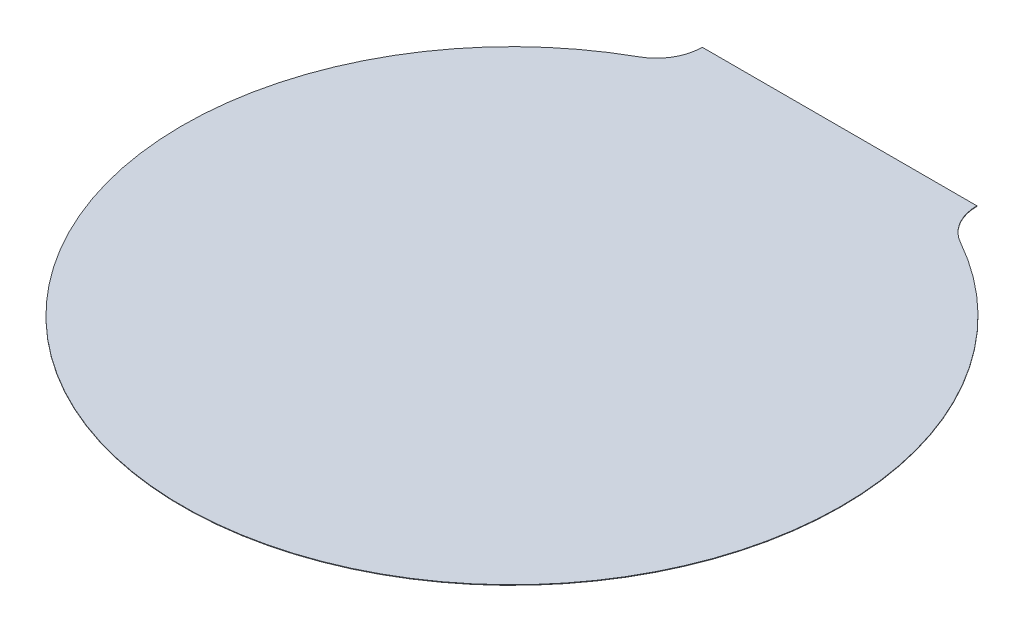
ISO-10303-21;
HEADER;
FILE_DESCRIPTION(('STEP AP214'),'2;1');
FILE_NAME('part.step','',(''),(''),'','','');
FILE_SCHEMA(('AUTOMOTIVE_DESIGN { 1 0 10303 214 1 1 1 1 }'));
ENDSEC;
DATA;
#1=APPLICATION_CONTEXT('core data for automotive mechanical design processes');
#2=APPLICATION_PROTOCOL_DEFINITION('international standard','automotive_design',2000,#1);
#3=PRODUCT_CONTEXT('',#1,'mechanical');
#4=PRODUCT('Part','Part','',(#3));
#5=PRODUCT_RELATED_PRODUCT_CATEGORY('part','',(#4));
#6=PRODUCT_DEFINITION_FORMATION('','',#4);
#7=PRODUCT_DEFINITION_CONTEXT('part definition',#1,'design');
#8=PRODUCT_DEFINITION('design','',#6,#7);
#9=PRODUCT_DEFINITION_SHAPE('','',#8);
#10=(LENGTH_UNIT() NAMED_UNIT(*) SI_UNIT(.MILLI.,.METRE.));
#11=(NAMED_UNIT(*) PLANE_ANGLE_UNIT() SI_UNIT($,.RADIAN.));
#12=(NAMED_UNIT(*) SI_UNIT($,.STERADIAN.) SOLID_ANGLE_UNIT());
#13=UNCERTAINTY_MEASURE_WITH_UNIT(LENGTH_MEASURE(1.E-05),#10,'distance_accuracy_value','');
#14=(GEOMETRIC_REPRESENTATION_CONTEXT(3) GLOBAL_UNCERTAINTY_ASSIGNED_CONTEXT((#13)) GLOBAL_UNIT_ASSIGNED_CONTEXT((#10,
#11,#12)) REPRESENTATION_CONTEXT('',''));
#15=CARTESIAN_POINT('',(0.,0.,0.));
#16=DIRECTION('',(0.,0.,1.));
#17=DIRECTION('',(1.,0.,0.));
#18=AXIS2_PLACEMENT_3D('',#15,#16,#17);
#19=CARTESIAN_POINT('',(-5.07969240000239,0.015,-9.09110120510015));
#20=DIRECTION('',(0.,-1.,0.));
#21=DIRECTION('',(0.,0.,-1.));
#22=AXIS2_PLACEMENT_3D('',#19,#20,#21);
#23=CYLINDRICAL_SURFACE('',#22,1.27000000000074);
#24=CARTESIAN_POINT('',(-5.07969240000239,0.,-9.09110120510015));
#25=DIRECTION('',(0.,-1.,0.));
#26=DIRECTION('',(0.,0.,1.));
#27=AXIS2_PLACEMENT_3D('',#24,#25,#26);
#28=CIRCLE('',#27,1.27000000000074);
#29=CARTESIAN_POINT('',(-3.80969240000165,0.,-9.09110120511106));
#30=VERTEX_POINT('',#29);
#31=CARTESIAN_POINT('',(-4.46021771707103,0.,-7.98243032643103));
#32=VERTEX_POINT('',#31);
#33=EDGE_CURVE('E93',#30,#32,#28,.T.);
#34=ORIENTED_EDGE('',*,*,#33,.T.);
#35=DIRECTION('',(0.,-1.,0.));
#36=VECTOR('',#35,1.);
#37=CARTESIAN_POINT('',(-4.46021771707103,0.015,-7.98243032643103));
#38=LINE('',#37,#36);
#39=CARTESIAN_POINT('',(-4.46021771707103,0.015,-7.98243032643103));
#40=VERTEX_POINT('',#39);
#41=EDGE_CURVE('E11',#40,#32,#38,.T.);
#42=ORIENTED_EDGE('',*,*,#41,.F.);
#43=CARTESIAN_POINT('',(-5.07969240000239,0.015,-9.09110120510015));
#44=DIRECTION('',(0.,-1.,0.));
#45=DIRECTION('',(0.,0.,1.));
#46=AXIS2_PLACEMENT_3D('',#43,#44,#45);
#47=CIRCLE('',#46,1.27000000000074);
#48=CARTESIAN_POINT('',(-3.80969240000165,0.015,-9.09110120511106));
#49=VERTEX_POINT('',#48);
#50=EDGE_CURVE('E81',#49,#40,#47,.T.);
#51=ORIENTED_EDGE('',*,*,#50,.F.);
#52=DIRECTION('',(0.,-1.,0.));
#53=VECTOR('',#52,1.);
#54=CARTESIAN_POINT('',(-3.80969240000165,0.015,-9.09110120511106));
#55=LINE('',#54,#53);
#56=EDGE_CURVE('E89',#49,#30,#55,.T.);
#57=ORIENTED_EDGE('',*,*,#56,.T.);
#58=EDGE_LOOP('',(#34,#42,#51,#57));
#59=FACE_BOUND('',#58,.T.);
#60=ADVANCED_FACE('F30',(#59),#23,.F.);
#61=CARTESIAN_POINT('',(0.,0.015,0.));
#62=DIRECTION('',(0.,-1.,0.));
#63=DIRECTION('',(0.,0.,-1.));
#64=AXIS2_PLACEMENT_3D('',#61,#62,#63);
#65=CYLINDRICAL_SURFACE('',#64,9.14400000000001);
#66=CARTESIAN_POINT('',(0.,0.,0.));
#67=DIRECTION('',(0.,1.,0.));
#68=DIRECTION('',(0.,0.,1.));
#69=AXIS2_PLACEMENT_3D('',#66,#67,#68);
#70=CIRCLE('',#69,9.14400000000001);
#71=CARTESIAN_POINT('',(4.4602177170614,0.,-7.98243032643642));
#72=VERTEX_POINT('',#71);
#73=EDGE_CURVE('E85',#32,#72,#70,.T.);
#74=ORIENTED_EDGE('',*,*,#73,.T.);
#75=DIRECTION('',(0.,-1.,0.));
#76=VECTOR('',#75,1.);
#77=CARTESIAN_POINT('',(4.4602177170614,0.015,-7.98243032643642));
#78=LINE('',#77,#76);
#79=CARTESIAN_POINT('',(4.4602177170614,0.015,-7.98243032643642));
#80=VERTEX_POINT('',#79);
#81=EDGE_CURVE('E38',#80,#72,#78,.T.);
#82=ORIENTED_EDGE('',*,*,#81,.F.);
#83=CARTESIAN_POINT('',(0.,0.015,0.));
#84=DIRECTION('',(0.,1.,0.));
#85=DIRECTION('',(0.,0.,1.));
#86=AXIS2_PLACEMENT_3D('',#83,#84,#85);
#87=CIRCLE('',#86,9.14400000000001);
#88=EDGE_CURVE('E76',#40,#80,#87,.T.);
#89=ORIENTED_EDGE('',*,*,#88,.F.);
#90=ORIENTED_EDGE('',*,*,#41,.T.);
#91=EDGE_LOOP('',(#74,#82,#89,#90));
#92=FACE_BOUND('',#91,.T.);
#93=ADVANCED_FACE('F84',(#92),#65,.T.);
#94=CARTESIAN_POINT('',(5.07969239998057,0.015,-9.09110120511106));
#95=DIRECTION('',(0.,-1.,0.));
#96=DIRECTION('',(0.,0.,-1.));
#97=AXIS2_PLACEMENT_3D('',#94,#95,#96);
#98=CYLINDRICAL_SURFACE('',#97,1.26999999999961);
#99=CARTESIAN_POINT('',(5.07969239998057,0.,-9.09110120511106));
#100=DIRECTION('',(0.,-1.,0.));
#101=DIRECTION('',(0.,0.,1.));
#102=AXIS2_PLACEMENT_3D('',#99,#100,#101);
#103=CIRCLE('',#102,1.26999999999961);
#104=CARTESIAN_POINT('',(3.80969239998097,0.,-9.09110120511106));
#105=VERTEX_POINT('',#104);
#106=EDGE_CURVE('E63',#72,#105,#103,.T.);
#107=ORIENTED_EDGE('',*,*,#106,.T.);
#108=DIRECTION('',(0.,-1.,0.));
#109=VECTOR('',#108,1.);
#110=CARTESIAN_POINT('',(3.80969239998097,0.015,-9.09110120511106));
#111=LINE('',#110,#109);
#112=CARTESIAN_POINT('',(3.80969239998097,0.015,-9.09110120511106));
#113=VERTEX_POINT('',#112);
#114=EDGE_CURVE('E86',#113,#105,#111,.T.);
#115=ORIENTED_EDGE('',*,*,#114,.F.);
#116=CARTESIAN_POINT('',(5.07969239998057,0.015,-9.09110120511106));
#117=DIRECTION('',(0.,-1.,0.));
#118=DIRECTION('',(0.,0.,1.));
#119=AXIS2_PLACEMENT_3D('',#116,#117,#118);
#120=CIRCLE('',#119,1.26999999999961);
#121=EDGE_CURVE('E79',#80,#113,#120,.T.);
#122=ORIENTED_EDGE('',*,*,#121,.F.);
#123=ORIENTED_EDGE('',*,*,#81,.T.);
#124=EDGE_LOOP('',(#107,#115,#122,#123));
#125=FACE_BOUND('',#124,.T.);
#126=ADVANCED_FACE('F87',(#125),#98,.F.);
#127=CARTESIAN_POINT('',(3.80969239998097,0.015,-9.09110120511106));
#128=DIRECTION('',(0.,0.,1.));
#129=DIRECTION('',(1.,0.,0.));
#130=AXIS2_PLACEMENT_3D('',#127,#128,#129);
#131=PLANE('',#130);
#132=DIRECTION('',(-1.,0.,0.));
#133=VECTOR('',#132,1.);
#134=CARTESIAN_POINT('',(3.80969239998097,0.,-9.09110120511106));
#135=LINE('',#134,#133);
#136=EDGE_CURVE('E69',#105,#30,#135,.T.);
#137=ORIENTED_EDGE('',*,*,#136,.T.);
#138=ORIENTED_EDGE('',*,*,#56,.F.);
#139=DIRECTION('',(-1.,0.,0.));
#140=VECTOR('',#139,1.);
#141=CARTESIAN_POINT('',(3.80969239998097,0.015,-9.09110120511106));
#142=LINE('',#141,#140);
#143=EDGE_CURVE('E46',#113,#49,#142,.T.);
#144=ORIENTED_EDGE('',*,*,#143,.F.);
#145=ORIENTED_EDGE('',*,*,#114,.T.);
#146=EDGE_LOOP('',(#137,#138,#144,#145));
#147=FACE_BOUND('',#146,.T.);
#148=ADVANCED_FACE('F100',(#147),#131,.F.);
#149=CARTESIAN_POINT('',(-5.07969240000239,0.015,-9.09110120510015));
#150=DIRECTION('',(0.,1.,0.));
#151=DIRECTION('',(0.,0.,1.));
#152=AXIS2_PLACEMENT_3D('',#149,#150,#151);
#153=PLANE('',#152);
#154=ORIENTED_EDGE('',*,*,#50,.T.);
#155=ORIENTED_EDGE('',*,*,#88,.T.);
#156=ORIENTED_EDGE('',*,*,#121,.T.);
#157=ORIENTED_EDGE('',*,*,#143,.T.);
#158=EDGE_LOOP('',(#154,#155,#156,#157));
#159=FACE_BOUND('',#158,.T.);
#160=ADVANCED_FACE('F77',(#159),#153,.T.);
#161=CARTESIAN_POINT('',(-5.07969240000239,0.,-9.09110120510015));
#162=DIRECTION('',(0.,1.,0.));
#163=DIRECTION('',(0.,0.,1.));
#164=AXIS2_PLACEMENT_3D('',#161,#162,#163);
#165=PLANE('',#164);
#166=ORIENTED_EDGE('',*,*,#33,.F.);
#167=ORIENTED_EDGE('',*,*,#136,.F.);
#168=ORIENTED_EDGE('',*,*,#106,.F.);
#169=ORIENTED_EDGE('',*,*,#73,.F.);
#170=EDGE_LOOP('',(#166,#167,#168,#169));
#171=FACE_BOUND('',#170,.T.);
#172=ADVANCED_FACE('F103',(#171),#165,.F.);
#173=CLOSED_SHELL('',(#60,#93,#126,#148,#160,#172));
#174=MANIFOLD_SOLID_BREP('B2',#173);
#175=ADVANCED_BREP_SHAPE_REPRESENTATION('',(#18,#174),#14);
#176=SHAPE_DEFINITION_REPRESENTATION(#9,#175);
ENDSEC;
END-ISO-10303-21;
